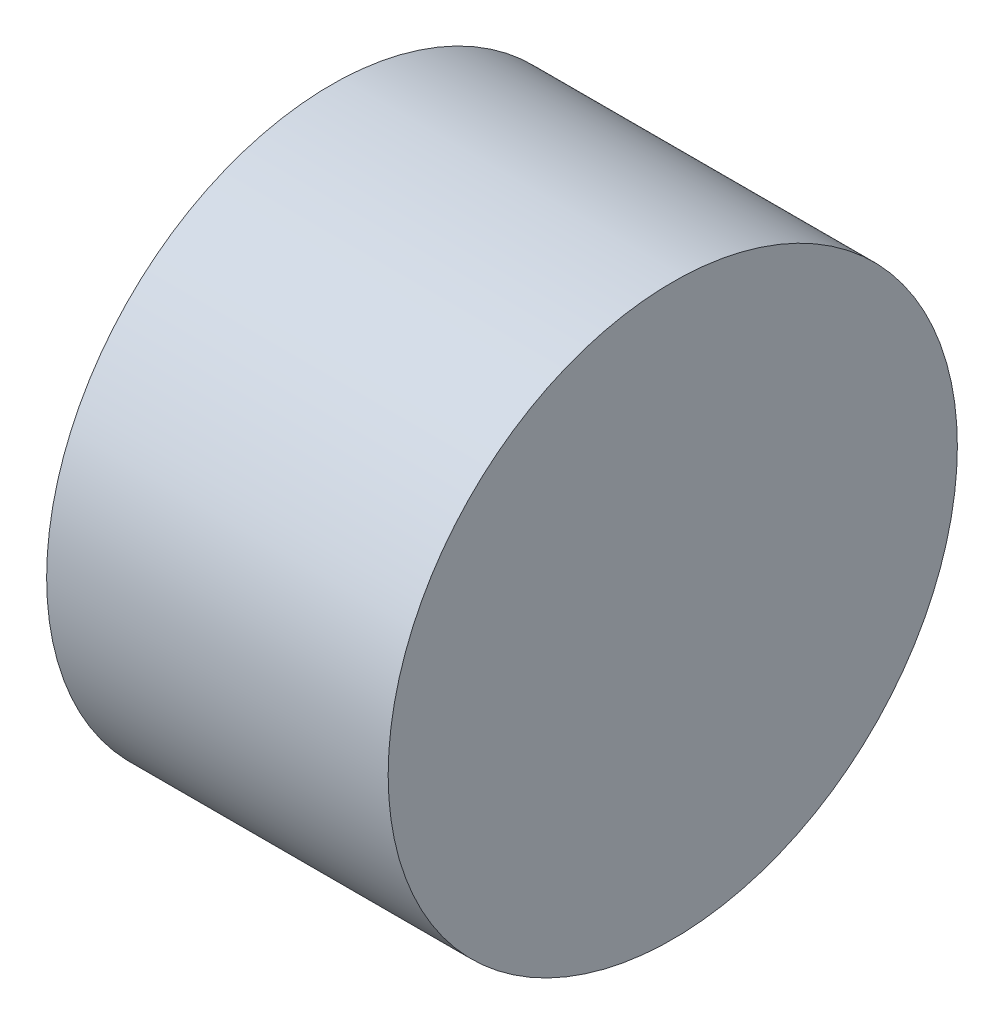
from build123d import *

# Parameters (mm, degrees)
SKETCH_1_R      = 25
EXTRUDE_1_DEPTH = 30


with BuildPart() as part:
    # Sketch 1 → Extrude 1 (new body)
    with BuildSketch(Plane(origin=(0, 0, 0), x_dir=(0, 0, -1), z_dir=(1, 0, 0))):
        Circle(SKETCH_1_R)
    extrude(amount=EXTRUDE_1_DEPTH)


solid = part.part
